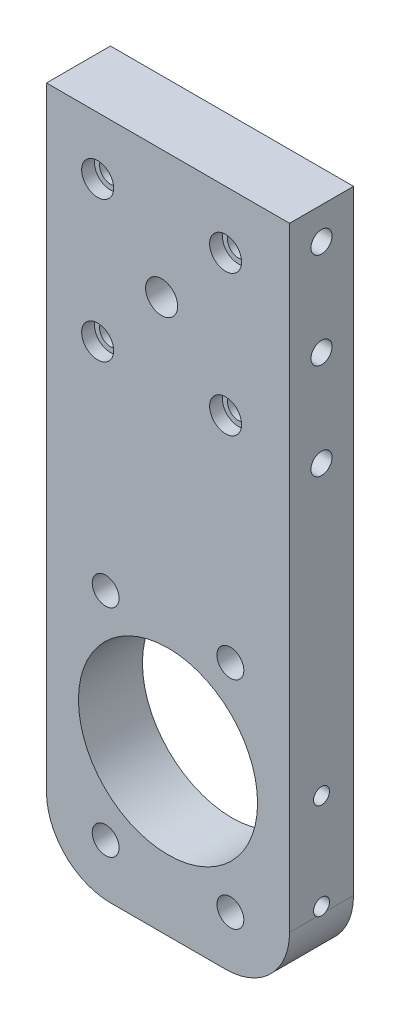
ISO-10303-21;
HEADER;
FILE_DESCRIPTION(('STEP AP214'),'2;1');
FILE_NAME('part.step','',(''),(''),'','','');
FILE_SCHEMA(('AUTOMOTIVE_DESIGN { 1 0 10303 214 1 1 1 1 }'));
ENDSEC;
DATA;
#1=APPLICATION_CONTEXT('core data for automotive mechanical design processes');
#2=APPLICATION_PROTOCOL_DEFINITION('international standard','automotive_design',2000,#1);
#3=PRODUCT_CONTEXT('',#1,'mechanical');
#4=PRODUCT('Part','Part','',(#3));
#5=PRODUCT_RELATED_PRODUCT_CATEGORY('part','',(#4));
#6=PRODUCT_DEFINITION_FORMATION('','',#4);
#7=PRODUCT_DEFINITION_CONTEXT('part definition',#1,'design');
#8=PRODUCT_DEFINITION('design','',#6,#7);
#9=PRODUCT_DEFINITION_SHAPE('','',#8);
#10=(LENGTH_UNIT() NAMED_UNIT(*) SI_UNIT(.MILLI.,.METRE.));
#11=(NAMED_UNIT(*) PLANE_ANGLE_UNIT() SI_UNIT($,.RADIAN.));
#12=(NAMED_UNIT(*) SI_UNIT($,.STERADIAN.) SOLID_ANGLE_UNIT());
#13=UNCERTAINTY_MEASURE_WITH_UNIT(LENGTH_MEASURE(1.E-05),#10,'distance_accuracy_value','');
#14=(GEOMETRIC_REPRESENTATION_CONTEXT(3) GLOBAL_UNCERTAINTY_ASSIGNED_CONTEXT((#13)) GLOBAL_UNIT_ASSIGNED_CONTEXT((#10,
#11,#12)) REPRESENTATION_CONTEXT('',''));
#15=CARTESIAN_POINT('',(0.,0.,0.));
#16=DIRECTION('',(0.,0.,1.));
#17=DIRECTION('',(1.,0.,0.));
#18=AXIS2_PLACEMENT_3D('',#15,#16,#17);
#19=CARTESIAN_POINT('',(12.5,20.,10.));
#20=DIRECTION('',(-1.,0.,0.));
#21=DIRECTION('',(0.,-1.,0.));
#22=AXIS2_PLACEMENT_3D('',#19,#20,#21);
#23=PLANE('',#22);
#24=CARTESIAN_POINT('',(12.5,-60.,5.0000000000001));
#25=DIRECTION('',(1.,0.,0.));
#26=DIRECTION('',(0.,0.,-1.));
#27=AXIS2_PLACEMENT_3D('',#24,#25,#26);
#28=CIRCLE('',#27,1.24999999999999);
#29=CARTESIAN_POINT('',(12.5,-60.,3.75000000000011));
#30=VERTEX_POINT('',#29);
#31=EDGE_CURVE('E726',#30,#30,#28,.T.);
#32=ORIENTED_EDGE('',*,*,#31,.F.);
#33=EDGE_LOOP('',(#32));
#34=FACE_BOUND('',#33,.T.);
#35=CARTESIAN_POINT('',(12.5,15.,5.));
#36=DIRECTION('',(1.,0.,0.));
#37=DIRECTION('',(0.,0.,-1.));
#38=AXIS2_PLACEMENT_3D('',#35,#36,#37);
#39=CIRCLE('',#38,1.65);
#40=CARTESIAN_POINT('',(12.5,15.,3.35));
#41=VERTEX_POINT('',#40);
#42=EDGE_CURVE('E181',#41,#41,#39,.T.);
#43=ORIENTED_EDGE('',*,*,#42,.F.);
#44=EDGE_LOOP('',(#43));
#45=FACE_BOUND('',#44,.T.);
#46=CARTESIAN_POINT('',(12.5,0.,5.));
#47=DIRECTION('',(1.,0.,0.));
#48=DIRECTION('',(0.,0.,-1.));
#49=AXIS2_PLACEMENT_3D('',#46,#47,#48);
#50=CIRCLE('',#49,1.65);
#51=CARTESIAN_POINT('',(12.5,0.,3.35));
#52=VERTEX_POINT('',#51);
#53=EDGE_CURVE('E175',#52,#52,#50,.T.);
#54=ORIENTED_EDGE('',*,*,#53,.F.);
#55=EDGE_LOOP('',(#54));
#56=FACE_BOUND('',#55,.T.);
#57=CARTESIAN_POINT('',(12.5,-15.,5.));
#58=DIRECTION('',(1.,0.,0.));
#59=DIRECTION('',(0.,0.,-1.));
#60=AXIS2_PLACEMENT_3D('',#57,#58,#59);
#61=CIRCLE('',#60,1.65);
#62=CARTESIAN_POINT('',(12.5,-15.,3.35));
#63=VERTEX_POINT('',#62);
#64=EDGE_CURVE('E169',#63,#63,#61,.T.);
#65=ORIENTED_EDGE('',*,*,#64,.F.);
#66=EDGE_LOOP('',(#65));
#67=FACE_BOUND('',#66,.T.);
#68=CARTESIAN_POINT('',(12.5,-75.,5.0000000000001));
#69=DIRECTION('',(1.,0.,0.));
#70=DIRECTION('',(0.,0.,-1.));
#71=AXIS2_PLACEMENT_3D('',#68,#69,#70);
#72=CIRCLE('',#71,1.24999999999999);
#73=CARTESIAN_POINT('',(12.5,-76.,4.24999999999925));
#74=VERTEX_POINT('',#73);
#75=CARTESIAN_POINT('',(12.5,-76.,5.75000000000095));
#76=VERTEX_POINT('',#75);
#77=EDGE_CURVE('E35',#74,#76,#72,.T.);
#78=ORIENTED_EDGE('',*,*,#77,.F.);
#79=DIRECTION('',(0.,0.,1.));
#80=VECTOR('',#79,1.);
#81=CARTESIAN_POINT('',(12.5,-76.,10.));
#82=LINE('',#81,#80);
#83=CARTESIAN_POINT('',(12.5,-76.,0.));
#84=VERTEX_POINT('',#83);
#85=EDGE_CURVE('E266',#74,#84,#82,.F.);
#86=ORIENTED_EDGE('',*,*,#85,.T.);
#87=DIRECTION('',(0.,1.,0.));
#88=VECTOR('',#87,1.);
#89=CARTESIAN_POINT('',(12.5,20.,0.));
#90=LINE('',#89,#88);
#91=CARTESIAN_POINT('',(12.5,20.,0.));
#92=VERTEX_POINT('',#91);
#93=EDGE_CURVE('E229',#84,#92,#90,.T.);
#94=ORIENTED_EDGE('',*,*,#93,.T.);
#95=DIRECTION('',(0.,0.,-1.));
#96=VECTOR('',#95,1.);
#97=CARTESIAN_POINT('',(12.5,20.,10.));
#98=LINE('',#97,#96);
#99=CARTESIAN_POINT('',(12.5,20.,10.));
#100=VERTEX_POINT('',#99);
#101=EDGE_CURVE('E239',#100,#92,#98,.T.);
#102=ORIENTED_EDGE('',*,*,#101,.F.);
#103=DIRECTION('',(0.,1.,0.));
#104=VECTOR('',#103,1.);
#105=CARTESIAN_POINT('',(12.5,20.,10.));
#106=LINE('',#105,#104);
#107=CARTESIAN_POINT('',(12.5,-76.,10.));
#108=VERTEX_POINT('',#107);
#109=EDGE_CURVE('E233',#108,#100,#106,.T.);
#110=ORIENTED_EDGE('',*,*,#109,.F.);
#111=EDGE_CURVE('E267',#108,#76,#82,.F.);
#112=ORIENTED_EDGE('',*,*,#111,.T.);
#113=EDGE_LOOP('',(#78,#86,#94,#102,#110,#112));
#114=FACE_BOUND('',#113,.T.);
#115=ADVANCED_FACE('F16',(#34,#45,#56,#67,#114),#23,.F.);
#116=CARTESIAN_POINT('',(2.5,-11.,0.));
#117=DIRECTION('',(0.,0.,-1.));
#118=DIRECTION('',(-1.,0.,0.));
#119=AXIS2_PLACEMENT_3D('',#116,#117,#118);
#120=CYLINDRICAL_SURFACE('',#119,1.7);
#121=CARTESIAN_POINT('',(2.5,-11.,3.4));
#122=DIRECTION('',(0.,0.,-1.));
#123=DIRECTION('',(-1.,0.,0.));
#124=AXIS2_PLACEMENT_3D('',#121,#122,#123);
#125=CIRCLE('',#124,1.7);
#126=CARTESIAN_POINT('',(0.8,-11.,3.4));
#127=VERTEX_POINT('',#126);
#128=EDGE_CURVE('E226',#127,#127,#125,.T.);
#129=ORIENTED_EDGE('',*,*,#128,.T.);
#130=EDGE_LOOP('',(#129));
#131=FACE_BOUND('',#130,.T.);
#132=CARTESIAN_POINT('',(2.5,-11.,8.));
#133=DIRECTION('',(0.,0.,1.));
#134=DIRECTION('',(1.,0.,0.));
#135=AXIS2_PLACEMENT_3D('',#132,#133,#134);
#136=CIRCLE('',#135,1.7);
#137=CARTESIAN_POINT('',(4.2,-11.,8.));
#138=VERTEX_POINT('',#137);
#139=EDGE_CURVE('E145',#138,#138,#136,.F.);
#140=ORIENTED_EDGE('',*,*,#139,.F.);
#141=EDGE_LOOP('',(#140));
#142=FACE_BOUND('',#141,.T.);
#143=ADVANCED_FACE('F406',(#131,#142),#120,.F.);
#144=CARTESIAN_POINT('',(2.5,11.,0.));
#145=DIRECTION('',(0.,0.,-1.));
#146=DIRECTION('',(-1.,0.,0.));
#147=AXIS2_PLACEMENT_3D('',#144,#145,#146);
#148=CYLINDRICAL_SURFACE('',#147,1.7);
#149=CARTESIAN_POINT('',(2.5,11.,3.4));
#150=DIRECTION('',(0.,0.,-1.));
#151=DIRECTION('',(-1.,0.,0.));
#152=AXIS2_PLACEMENT_3D('',#149,#150,#151);
#153=CIRCLE('',#152,1.7);
#154=CARTESIAN_POINT('',(0.8,11.,3.4));
#155=VERTEX_POINT('',#154);
#156=EDGE_CURVE('E217',#155,#155,#153,.T.);
#157=ORIENTED_EDGE('',*,*,#156,.T.);
#158=EDGE_LOOP('',(#157));
#159=FACE_BOUND('',#158,.T.);
#160=CARTESIAN_POINT('',(2.5,11.,8.));
#161=DIRECTION('',(0.,0.,1.));
#162=DIRECTION('',(1.,0.,0.));
#163=AXIS2_PLACEMENT_3D('',#160,#161,#162);
#164=CIRCLE('',#163,1.7);
#165=CARTESIAN_POINT('',(4.2,11.,8.));
#166=VERTEX_POINT('',#165);
#167=EDGE_CURVE('E151',#166,#166,#164,.F.);
#168=ORIENTED_EDGE('',*,*,#167,.F.);
#169=EDGE_LOOP('',(#168));
#170=FACE_BOUND('',#169,.T.);
#171=ADVANCED_FACE('F394',(#159,#170),#148,.F.);
#172=CARTESIAN_POINT('',(-17.5,11.,0.));
#173=DIRECTION('',(0.,0.,-1.));
#174=DIRECTION('',(-1.,0.,0.));
#175=AXIS2_PLACEMENT_3D('',#172,#173,#174);
#176=CYLINDRICAL_SURFACE('',#175,1.7);
#177=CARTESIAN_POINT('',(-17.5,11.,3.4));
#178=DIRECTION('',(0.,0.,-1.));
#179=DIRECTION('',(-1.,0.,0.));
#180=AXIS2_PLACEMENT_3D('',#177,#178,#179);
#181=CIRCLE('',#180,1.7);
#182=CARTESIAN_POINT('',(-19.2,11.,3.4));
#183=VERTEX_POINT('',#182);
#184=EDGE_CURVE('E208',#183,#183,#181,.T.);
#185=ORIENTED_EDGE('',*,*,#184,.T.);
#186=EDGE_LOOP('',(#185));
#187=FACE_BOUND('',#186,.T.);
#188=CARTESIAN_POINT('',(-17.5,11.,8.));
#189=DIRECTION('',(0.,0.,1.));
#190=DIRECTION('',(1.,0.,0.));
#191=AXIS2_PLACEMENT_3D('',#188,#189,#190);
#192=CIRCLE('',#191,1.7);
#193=CARTESIAN_POINT('',(-15.8,11.,8.));
#194=VERTEX_POINT('',#193);
#195=EDGE_CURVE('E158',#194,#194,#192,.F.);
#196=ORIENTED_EDGE('',*,*,#195,.F.);
#197=EDGE_LOOP('',(#196));
#198=FACE_BOUND('',#197,.T.);
#199=ADVANCED_FACE('F382',(#187,#198),#176,.F.);
#200=CARTESIAN_POINT('',(-17.5,-11.,0.));
#201=DIRECTION('',(0.,0.,-1.));
#202=DIRECTION('',(-1.,0.,0.));
#203=AXIS2_PLACEMENT_3D('',#200,#201,#202);
#204=CYLINDRICAL_SURFACE('',#203,1.7);
#205=CARTESIAN_POINT('',(-17.5,-11.,3.4));
#206=DIRECTION('',(0.,0.,-1.));
#207=DIRECTION('',(-1.,0.,0.));
#208=AXIS2_PLACEMENT_3D('',#205,#206,#207);
#209=CIRCLE('',#208,1.7);
#210=CARTESIAN_POINT('',(-19.2,-11.,3.4));
#211=VERTEX_POINT('',#210);
#212=EDGE_CURVE('E199',#211,#211,#209,.T.);
#213=ORIENTED_EDGE('',*,*,#212,.T.);
#214=EDGE_LOOP('',(#213));
#215=FACE_BOUND('',#214,.T.);
#216=CARTESIAN_POINT('',(-17.5,-11.,8.));
#217=DIRECTION('',(0.,0.,1.));
#218=DIRECTION('',(1.,0.,0.));
#219=AXIS2_PLACEMENT_3D('',#216,#217,#218);
#220=CIRCLE('',#219,1.7);
#221=CARTESIAN_POINT('',(-15.8,-11.,8.));
#222=VERTEX_POINT('',#221);
#223=EDGE_CURVE('E165',#222,#222,#220,.F.);
#224=ORIENTED_EDGE('',*,*,#223,.F.);
#225=EDGE_LOOP('',(#224));
#226=FACE_BOUND('',#225,.T.);
#227=ADVANCED_FACE('F378',(#215,#226),#204,.F.);
#228=CARTESIAN_POINT('',(-27.5,20.,10.));
#229=DIRECTION('',(0.,-1.,0.));
#230=DIRECTION('',(0.,0.,-1.));
#231=AXIS2_PLACEMENT_3D('',#228,#229,#230);
#232=PLANE('',#231);
#233=DIRECTION('',(-1.,0.,0.));
#234=VECTOR('',#233,1.);
#235=CARTESIAN_POINT('',(-27.5,20.,0.));
#236=LINE('',#235,#234);
#237=CARTESIAN_POINT('',(-25.5,20.,0.));
#238=VERTEX_POINT('',#237);
#239=EDGE_CURVE('E234',#92,#238,#236,.T.);
#240=ORIENTED_EDGE('',*,*,#239,.T.);
#241=DIRECTION('',(0.,0.,-1.));
#242=VECTOR('',#241,1.);
#243=CARTESIAN_POINT('',(-25.5,20.,10.));
#244=LINE('',#243,#242);
#245=CARTESIAN_POINT('',(-25.5,20.,10.));
#246=VERTEX_POINT('',#245);
#247=EDGE_CURVE('E243',#246,#238,#244,.T.);
#248=ORIENTED_EDGE('',*,*,#247,.F.);
#249=DIRECTION('',(-1.,0.,0.));
#250=VECTOR('',#249,1.);
#251=CARTESIAN_POINT('',(-27.5,20.,10.));
#252=LINE('',#251,#250);
#253=EDGE_CURVE('E230',#100,#246,#252,.T.);
#254=ORIENTED_EDGE('',*,*,#253,.F.);
#255=ORIENTED_EDGE('',*,*,#101,.T.);
#256=EDGE_LOOP('',(#240,#248,#254,#255));
#257=FACE_BOUND('',#256,.T.);
#258=ADVANCED_FACE('F381',(#257),#232,.F.);
#259=CARTESIAN_POINT('',(-25.5,20.,10.));
#260=DIRECTION('',(1.,0.,0.));
#261=DIRECTION('',(0.,1.,0.));
#262=AXIS2_PLACEMENT_3D('',#259,#260,#261);
#263=PLANE('',#262);
#264=DIRECTION('',(0.,-1.,0.));
#265=VECTOR('',#264,1.);
#266=CARTESIAN_POINT('',(-25.5,20.,0.));
#267=LINE('',#266,#265);
#268=CARTESIAN_POINT('',(-25.5,-76.,0.));
#269=VERTEX_POINT('',#268);
#270=EDGE_CURVE('E236',#238,#269,#267,.T.);
#271=ORIENTED_EDGE('',*,*,#270,.T.);
#272=DIRECTION('',(0.,0.,-1.));
#273=VECTOR('',#272,1.);
#274=CARTESIAN_POINT('',(-25.5,-76.,10.));
#275=LINE('',#274,#273);
#276=CARTESIAN_POINT('',(-25.5,-76.,10.));
#277=VERTEX_POINT('',#276);
#278=EDGE_CURVE('E30',#269,#277,#275,.F.);
#279=ORIENTED_EDGE('',*,*,#278,.T.);
#280=DIRECTION('',(0.,-1.,0.));
#281=VECTOR('',#280,1.);
#282=CARTESIAN_POINT('',(-25.5,20.,10.));
#283=LINE('',#282,#281);
#284=EDGE_CURVE('E232',#246,#277,#283,.T.);
#285=ORIENTED_EDGE('',*,*,#284,.F.);
#286=ORIENTED_EDGE('',*,*,#247,.T.);
#287=EDGE_LOOP('',(#271,#279,#285,#286));
#288=FACE_BOUND('',#287,.T.);
#289=ADVANCED_FACE('F422',(#288),#263,.F.);
#290=CARTESIAN_POINT('',(0.,0.,10.));
#291=DIRECTION('',(0.,0.,1.));
#292=DIRECTION('',(1.,0.,0.));
#293=AXIS2_PLACEMENT_3D('',#290,#291,#292);
#294=PLANE('',#293);
#295=CARTESIAN_POINT('',(-16.25,-44.1125046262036,10.));
#296=DIRECTION('',(0.,0.,-1.));
#297=DIRECTION('',(-1.,0.,0.));
#298=AXIS2_PLACEMENT_3D('',#295,#296,#297);
#299=CIRCLE('',#298,2.1);
#300=CARTESIAN_POINT('',(-18.35,-44.1125046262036,10.));
#301=VERTEX_POINT('',#300);
#302=EDGE_CURVE('E104',#301,#301,#299,.T.);
#303=ORIENTED_EDGE('',*,*,#302,.T.);
#304=EDGE_LOOP('',(#303));
#305=FACE_BOUND('',#304,.T.);
#306=CARTESIAN_POINT('',(-16.25,-77.8874953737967,10.));
#307=DIRECTION('',(0.,0.,-1.));
#308=DIRECTION('',(-1.,0.,0.));
#309=AXIS2_PLACEMENT_3D('',#306,#307,#308);
#310=CIRCLE('',#309,2.1);
#311=CARTESIAN_POINT('',(-18.35,-77.8874953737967,10.));
#312=VERTEX_POINT('',#311);
#313=EDGE_CURVE('E114',#312,#312,#310,.T.);
#314=ORIENTED_EDGE('',*,*,#313,.T.);
#315=EDGE_LOOP('',(#314));
#316=FACE_BOUND('',#315,.T.);
#317=CARTESIAN_POINT('',(3.25,-44.1125046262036,10.));
#318=DIRECTION('',(0.,0.,-1.));
#319=DIRECTION('',(-1.,0.,0.));
#320=AXIS2_PLACEMENT_3D('',#317,#318,#319);
#321=CIRCLE('',#320,2.1);
#322=CARTESIAN_POINT('',(1.15,-44.1125046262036,10.));
#323=VERTEX_POINT('',#322);
#324=EDGE_CURVE('E120',#323,#323,#321,.T.);
#325=ORIENTED_EDGE('',*,*,#324,.T.);
#326=EDGE_LOOP('',(#325));
#327=FACE_BOUND('',#326,.T.);
#328=CARTESIAN_POINT('',(3.25,-77.8874953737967,10.));
#329=DIRECTION('',(0.,0.,-1.));
#330=DIRECTION('',(-1.,0.,0.));
#331=AXIS2_PLACEMENT_3D('',#328,#329,#330);
#332=CIRCLE('',#331,2.1);
#333=CARTESIAN_POINT('',(1.15,-77.8874953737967,10.));
#334=VERTEX_POINT('',#333);
#335=EDGE_CURVE('E126',#334,#334,#332,.T.);
#336=ORIENTED_EDGE('',*,*,#335,.T.);
#337=EDGE_LOOP('',(#336));
#338=FACE_BOUND('',#337,.T.);
#339=CARTESIAN_POINT('',(-6.5,-61.,10.));
#340=DIRECTION('',(0.,0.,1.));
#341=DIRECTION('',(1.,0.,0.));
#342=AXIS2_PLACEMENT_3D('',#339,#340,#341);
#343=CIRCLE('',#342,14.);
#344=CARTESIAN_POINT('',(7.5,-61.,10.));
#345=VERTEX_POINT('',#344);
#346=EDGE_CURVE('E129',#345,#345,#343,.T.);
#347=ORIENTED_EDGE('',*,*,#346,.F.);
#348=EDGE_LOOP('',(#347));
#349=FACE_BOUND('',#348,.T.);
#350=CARTESIAN_POINT('',(2.5,-11.,10.));
#351=DIRECTION('',(0.,0.,1.));
#352=DIRECTION('',(1.,0.,0.));
#353=AXIS2_PLACEMENT_3D('',#350,#351,#352);
#354=CIRCLE('',#353,2.5);
#355=CARTESIAN_POINT('',(5.,-11.,10.));
#356=VERTEX_POINT('',#355);
#357=EDGE_CURVE('E141',#356,#356,#354,.T.);
#358=ORIENTED_EDGE('',*,*,#357,.F.);
#359=EDGE_LOOP('',(#358));
#360=FACE_BOUND('',#359,.T.);
#361=CARTESIAN_POINT('',(2.5,11.,10.));
#362=DIRECTION('',(0.,0.,1.));
#363=DIRECTION('',(1.,0.,0.));
#364=AXIS2_PLACEMENT_3D('',#361,#362,#363);
#365=CIRCLE('',#364,2.5);
#366=CARTESIAN_POINT('',(5.,11.,10.));
#367=VERTEX_POINT('',#366);
#368=EDGE_CURVE('E152',#367,#367,#365,.T.);
#369=ORIENTED_EDGE('',*,*,#368,.F.);
#370=EDGE_LOOP('',(#369));
#371=FACE_BOUND('',#370,.T.);
#372=CARTESIAN_POINT('',(-17.5,11.,10.));
#373=DIRECTION('',(0.,0.,1.));
#374=DIRECTION('',(1.,0.,0.));
#375=AXIS2_PLACEMENT_3D('',#372,#373,#374);
#376=CIRCLE('',#375,2.5);
#377=CARTESIAN_POINT('',(-15.,11.,10.));
#378=VERTEX_POINT('',#377);
#379=EDGE_CURVE('E159',#378,#378,#376,.T.);
#380=ORIENTED_EDGE('',*,*,#379,.F.);
#381=EDGE_LOOP('',(#380));
#382=FACE_BOUND('',#381,.T.);
#383=CARTESIAN_POINT('',(-17.5,-11.,10.));
#384=DIRECTION('',(0.,0.,1.));
#385=DIRECTION('',(1.,0.,0.));
#386=AXIS2_PLACEMENT_3D('',#383,#384,#385);
#387=CIRCLE('',#386,2.5);
#388=CARTESIAN_POINT('',(-15.,-11.,10.));
#389=VERTEX_POINT('',#388);
#390=EDGE_CURVE('E166',#389,#389,#387,.T.);
#391=ORIENTED_EDGE('',*,*,#390,.F.);
#392=EDGE_LOOP('',(#391));
#393=FACE_BOUND('',#392,.T.);
#394=CARTESIAN_POINT('',(-7.5,0.,10.));
#395=DIRECTION('',(0.,0.,-1.));
#396=DIRECTION('',(-1.,0.,0.));
#397=AXIS2_PLACEMENT_3D('',#394,#395,#396);
#398=CIRCLE('',#397,2.5);
#399=CARTESIAN_POINT('',(-10.,0.,10.));
#400=VERTEX_POINT('',#399);
#401=EDGE_CURVE('E190',#400,#400,#398,.T.);
#402=ORIENTED_EDGE('',*,*,#401,.T.);
#403=EDGE_LOOP('',(#402));
#404=FACE_BOUND('',#403,.T.);
#405=DIRECTION('',(-1.,0.,0.));
#406=VECTOR('',#405,1.);
#407=CARTESIAN_POINT('',(12.5,-86.,10.));
#408=LINE('',#407,#406);
#409=CARTESIAN_POINT('',(2.5,-86.,10.));
#410=VERTEX_POINT('',#409);
#411=CARTESIAN_POINT('',(-15.5,-86.,10.));
#412=VERTEX_POINT('',#411);
#413=EDGE_CURVE('E133',#410,#412,#408,.T.);
#414=ORIENTED_EDGE('',*,*,#413,.F.);
#415=CARTESIAN_POINT('',(2.5,-76.,10.));
#416=DIRECTION('',(0.,0.,1.));
#417=DIRECTION('',(1.,0.,0.));
#418=AXIS2_PLACEMENT_3D('',#415,#416,#417);
#419=CIRCLE('',#418,10.);
#420=EDGE_CURVE('E264',#410,#108,#419,.T.);
#421=ORIENTED_EDGE('',*,*,#420,.T.);
#422=ORIENTED_EDGE('',*,*,#109,.T.);
#423=ORIENTED_EDGE('',*,*,#253,.T.);
#424=ORIENTED_EDGE('',*,*,#284,.T.);
#425=CARTESIAN_POINT('',(-15.5,-76.,10.));
#426=DIRECTION('',(0.,0.,1.));
#427=DIRECTION('',(1.,0.,0.));
#428=AXIS2_PLACEMENT_3D('',#425,#426,#427);
#429=CIRCLE('',#428,10.);
#430=EDGE_CURVE('E262',#277,#412,#429,.T.);
#431=ORIENTED_EDGE('',*,*,#430,.T.);
#432=EDGE_LOOP('',(#414,#421,#422,#423,#424,#431));
#433=FACE_BOUND('',#432,.T.);
#434=ADVANCED_FACE('F419',(#305,#316,#327,#338,#349,#360,#371,#382,#393,#404,#433),#294,.T.);
#435=CARTESIAN_POINT('',(0.,0.,0.));
#436=DIRECTION('',(0.,0.,1.));
#437=DIRECTION('',(1.,0.,0.));
#438=AXIS2_PLACEMENT_3D('',#435,#436,#437);
#439=PLANE('',#438);
#440=CARTESIAN_POINT('',(-16.25,-44.1125046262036,0.));
#441=DIRECTION('',(0.,0.,-1.));
#442=DIRECTION('',(-1.,0.,0.));
#443=AXIS2_PLACEMENT_3D('',#440,#441,#442);
#444=CIRCLE('',#443,2.1);
#445=CARTESIAN_POINT('',(-18.35,-44.1125046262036,0.));
#446=VERTEX_POINT('',#445);
#447=EDGE_CURVE('E101',#446,#446,#444,.T.);
#448=ORIENTED_EDGE('',*,*,#447,.F.);
#449=EDGE_LOOP('',(#448));
#450=FACE_BOUND('',#449,.T.);
#451=CARTESIAN_POINT('',(-16.25,-77.8874953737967,0.));
#452=DIRECTION('',(0.,0.,-1.));
#453=DIRECTION('',(-1.,0.,0.));
#454=AXIS2_PLACEMENT_3D('',#451,#452,#453);
#455=CIRCLE('',#454,2.1);
#456=CARTESIAN_POINT('',(-18.35,-77.8874953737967,0.));
#457=VERTEX_POINT('',#456);
#458=EDGE_CURVE('E111',#457,#457,#455,.T.);
#459=ORIENTED_EDGE('',*,*,#458,.F.);
#460=EDGE_LOOP('',(#459));
#461=FACE_BOUND('',#460,.T.);
#462=CARTESIAN_POINT('',(3.25,-44.1125046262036,0.));
#463=DIRECTION('',(0.,0.,-1.));
#464=DIRECTION('',(-1.,0.,0.));
#465=AXIS2_PLACEMENT_3D('',#462,#463,#464);
#466=CIRCLE('',#465,2.1);
#467=CARTESIAN_POINT('',(1.15,-44.1125046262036,0.));
#468=VERTEX_POINT('',#467);
#469=EDGE_CURVE('E117',#468,#468,#466,.T.);
#470=ORIENTED_EDGE('',*,*,#469,.F.);
#471=EDGE_LOOP('',(#470));
#472=FACE_BOUND('',#471,.T.);
#473=CARTESIAN_POINT('',(3.25,-77.8874953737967,0.));
#474=DIRECTION('',(0.,0.,-1.));
#475=DIRECTION('',(-1.,0.,0.));
#476=AXIS2_PLACEMENT_3D('',#473,#474,#475);
#477=CIRCLE('',#476,2.1);
#478=CARTESIAN_POINT('',(1.15,-77.8874953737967,0.));
#479=VERTEX_POINT('',#478);
#480=EDGE_CURVE('E123',#479,#479,#477,.T.);
#481=ORIENTED_EDGE('',*,*,#480,.F.);
#482=EDGE_LOOP('',(#481));
#483=FACE_BOUND('',#482,.T.);
#484=CARTESIAN_POINT('',(-6.5,-61.,0.));
#485=DIRECTION('',(0.,0.,1.));
#486=DIRECTION('',(1.,0.,0.));
#487=AXIS2_PLACEMENT_3D('',#484,#485,#486);
#488=CIRCLE('',#487,14.);
#489=CARTESIAN_POINT('',(7.5,-61.,0.));
#490=VERTEX_POINT('',#489);
#491=EDGE_CURVE('E130',#490,#490,#488,.T.);
#492=ORIENTED_EDGE('',*,*,#491,.T.);
#493=EDGE_LOOP('',(#492));
#494=FACE_BOUND('',#493,.T.);
#495=CARTESIAN_POINT('',(-7.5,0.,0.));
#496=DIRECTION('',(0.,0.,-1.));
#497=DIRECTION('',(-1.,0.,0.));
#498=AXIS2_PLACEMENT_3D('',#495,#496,#497);
#499=CIRCLE('',#498,2.5);
#500=CARTESIAN_POINT('',(-10.,0.,0.));
#501=VERTEX_POINT('',#500);
#502=EDGE_CURVE('E187',#501,#501,#499,.T.);
#503=ORIENTED_EDGE('',*,*,#502,.F.);
#504=EDGE_LOOP('',(#503));
#505=FACE_BOUND('',#504,.T.);
#506=CARTESIAN_POINT('',(-17.5,-11.,0.));
#507=DIRECTION('',(0.,0.,-1.));
#508=DIRECTION('',(-1.,0.,0.));
#509=AXIS2_PLACEMENT_3D('',#506,#507,#508);
#510=CIRCLE('',#509,3.);
#511=CARTESIAN_POINT('',(-20.5,-11.,0.));
#512=VERTEX_POINT('',#511);
#513=EDGE_CURVE('E193',#512,#512,#510,.T.);
#514=ORIENTED_EDGE('',*,*,#513,.F.);
#515=EDGE_LOOP('',(#514));
#516=FACE_BOUND('',#515,.T.);
#517=CARTESIAN_POINT('',(-17.5,11.,0.));
#518=DIRECTION('',(0.,0.,-1.));
#519=DIRECTION('',(-1.,0.,0.));
#520=AXIS2_PLACEMENT_3D('',#517,#518,#519);
#521=CIRCLE('',#520,3.);
#522=CARTESIAN_POINT('',(-20.5,11.,0.));
#523=VERTEX_POINT('',#522);
#524=EDGE_CURVE('E202',#523,#523,#521,.T.);
#525=ORIENTED_EDGE('',*,*,#524,.F.);
#526=EDGE_LOOP('',(#525));
#527=FACE_BOUND('',#526,.T.);
#528=CARTESIAN_POINT('',(2.5,11.,0.));
#529=DIRECTION('',(0.,0.,-1.));
#530=DIRECTION('',(-1.,0.,0.));
#531=AXIS2_PLACEMENT_3D('',#528,#529,#530);
#532=CIRCLE('',#531,3.);
#533=CARTESIAN_POINT('',(-0.5,11.,0.));
#534=VERTEX_POINT('',#533);
#535=EDGE_CURVE('E211',#534,#534,#532,.T.);
#536=ORIENTED_EDGE('',*,*,#535,.F.);
#537=EDGE_LOOP('',(#536));
#538=FACE_BOUND('',#537,.T.);
#539=CARTESIAN_POINT('',(2.5,-11.,0.));
#540=DIRECTION('',(0.,0.,-1.));
#541=DIRECTION('',(-1.,0.,0.));
#542=AXIS2_PLACEMENT_3D('',#539,#540,#541);
#543=CIRCLE('',#542,3.);
#544=CARTESIAN_POINT('',(-0.5,-11.,0.));
#545=VERTEX_POINT('',#544);
#546=EDGE_CURVE('E220',#545,#545,#543,.T.);
#547=ORIENTED_EDGE('',*,*,#546,.F.);
#548=EDGE_LOOP('',(#547));
#549=FACE_BOUND('',#548,.T.);
#550=ORIENTED_EDGE('',*,*,#93,.F.);
#551=CARTESIAN_POINT('',(2.5,-76.,0.));
#552=DIRECTION('',(0.,0.,1.));
#553=DIRECTION('',(1.,0.,0.));
#554=AXIS2_PLACEMENT_3D('',#551,#552,#553);
#555=CIRCLE('',#554,10.);
#556=CARTESIAN_POINT('',(2.5,-86.,0.));
#557=VERTEX_POINT('',#556);
#558=EDGE_CURVE('E271',#84,#557,#555,.F.);
#559=ORIENTED_EDGE('',*,*,#558,.T.);
#560=DIRECTION('',(1.,0.,0.));
#561=VECTOR('',#560,1.);
#562=CARTESIAN_POINT('',(12.5,-86.,0.));
#563=LINE('',#562,#561);
#564=CARTESIAN_POINT('',(-15.5,-86.,0.));
#565=VERTEX_POINT('',#564);
#566=EDGE_CURVE('E138',#565,#557,#563,.T.);
#567=ORIENTED_EDGE('',*,*,#566,.F.);
#568=CARTESIAN_POINT('',(-15.5,-76.,0.));
#569=DIRECTION('',(0.,0.,1.));
#570=DIRECTION('',(1.,0.,0.));
#571=AXIS2_PLACEMENT_3D('',#568,#569,#570);
#572=CIRCLE('',#571,10.);
#573=EDGE_CURVE('E43',#565,#269,#572,.F.);
#574=ORIENTED_EDGE('',*,*,#573,.T.);
#575=ORIENTED_EDGE('',*,*,#270,.F.);
#576=ORIENTED_EDGE('',*,*,#239,.F.);
#577=EDGE_LOOP('',(#550,#559,#567,#574,#575,#576));
#578=FACE_BOUND('',#577,.T.);
#579=ADVANCED_FACE('F414',(#450,#461,#472,#483,#494,#505,#516,#527,#538,#549,#578),#439,.F.);
#580=CARTESIAN_POINT('',(4.2,-11.,3.4));
#581=DIRECTION('',(0.,0.,1.));
#582=DIRECTION('',(1.,0.,0.));
#583=AXIS2_PLACEMENT_3D('',#580,#581,#582);
#584=PLANE('',#583);
#585=ORIENTED_EDGE('',*,*,#128,.F.);
#586=EDGE_LOOP('',(#585));
#587=FACE_BOUND('',#586,.T.);
#588=CARTESIAN_POINT('',(2.5,-11.,3.4));
#589=DIRECTION('',(0.,0.,-1.));
#590=DIRECTION('',(-1.,0.,0.));
#591=AXIS2_PLACEMENT_3D('',#588,#589,#590);
#592=CIRCLE('',#591,3.);
#593=CARTESIAN_POINT('',(-0.5,-11.,3.4));
#594=VERTEX_POINT('',#593);
#595=EDGE_CURVE('E223',#594,#594,#592,.T.);
#596=ORIENTED_EDGE('',*,*,#595,.T.);
#597=EDGE_LOOP('',(#596));
#598=FACE_BOUND('',#597,.T.);
#599=ADVANCED_FACE('F410',(#587,#598),#584,.F.);
#600=CARTESIAN_POINT('',(2.5,-11.,0.));
#601=DIRECTION('',(0.,0.,-1.));
#602=DIRECTION('',(-1.,0.,0.));
#603=AXIS2_PLACEMENT_3D('',#600,#601,#602);
#604=CYLINDRICAL_SURFACE('',#603,3.);
#605=ORIENTED_EDGE('',*,*,#595,.F.);
#606=EDGE_LOOP('',(#605));
#607=FACE_BOUND('',#606,.T.);
#608=ORIENTED_EDGE('',*,*,#546,.T.);
#609=EDGE_LOOP('',(#608));
#610=FACE_BOUND('',#609,.T.);
#611=ADVANCED_FACE('F402',(#607,#610),#604,.F.);
#612=CARTESIAN_POINT('',(4.2,11.,3.4));
#613=DIRECTION('',(0.,0.,1.));
#614=DIRECTION('',(1.,0.,0.));
#615=AXIS2_PLACEMENT_3D('',#612,#613,#614);
#616=PLANE('',#615);
#617=ORIENTED_EDGE('',*,*,#156,.F.);
#618=EDGE_LOOP('',(#617));
#619=FACE_BOUND('',#618,.T.);
#620=CARTESIAN_POINT('',(2.5,11.,3.4));
#621=DIRECTION('',(0.,0.,-1.));
#622=DIRECTION('',(-1.,0.,0.));
#623=AXIS2_PLACEMENT_3D('',#620,#621,#622);
#624=CIRCLE('',#623,3.);
#625=CARTESIAN_POINT('',(-0.5,11.,3.4));
#626=VERTEX_POINT('',#625);
#627=EDGE_CURVE('E214',#626,#626,#624,.T.);
#628=ORIENTED_EDGE('',*,*,#627,.T.);
#629=EDGE_LOOP('',(#628));
#630=FACE_BOUND('',#629,.T.);
#631=ADVANCED_FACE('F398',(#619,#630),#616,.F.);
#632=CARTESIAN_POINT('',(2.5,11.,0.));
#633=DIRECTION('',(0.,0.,-1.));
#634=DIRECTION('',(-1.,0.,0.));
#635=AXIS2_PLACEMENT_3D('',#632,#633,#634);
#636=CYLINDRICAL_SURFACE('',#635,3.);
#637=ORIENTED_EDGE('',*,*,#627,.F.);
#638=EDGE_LOOP('',(#637));
#639=FACE_BOUND('',#638,.T.);
#640=ORIENTED_EDGE('',*,*,#535,.T.);
#641=EDGE_LOOP('',(#640));
#642=FACE_BOUND('',#641,.T.);
#643=ADVANCED_FACE('F390',(#639,#642),#636,.F.);
#644=CARTESIAN_POINT('',(-15.8,11.,3.4));
#645=DIRECTION('',(0.,0.,1.));
#646=DIRECTION('',(1.,0.,0.));
#647=AXIS2_PLACEMENT_3D('',#644,#645,#646);
#648=PLANE('',#647);
#649=ORIENTED_EDGE('',*,*,#184,.F.);
#650=EDGE_LOOP('',(#649));
#651=FACE_BOUND('',#650,.T.);
#652=CARTESIAN_POINT('',(-17.5,11.,3.4));
#653=DIRECTION('',(0.,0.,-1.));
#654=DIRECTION('',(-1.,0.,0.));
#655=AXIS2_PLACEMENT_3D('',#652,#653,#654);
#656=CIRCLE('',#655,3.);
#657=CARTESIAN_POINT('',(-20.5,11.,3.4));
#658=VERTEX_POINT('',#657);
#659=EDGE_CURVE('E205',#658,#658,#656,.T.);
#660=ORIENTED_EDGE('',*,*,#659,.T.);
#661=EDGE_LOOP('',(#660));
#662=FACE_BOUND('',#661,.T.);
#663=ADVANCED_FACE('F386',(#651,#662),#648,.F.);
#664=CARTESIAN_POINT('',(-17.5,11.,0.));
#665=DIRECTION('',(0.,0.,-1.));
#666=DIRECTION('',(-1.,0.,0.));
#667=AXIS2_PLACEMENT_3D('',#664,#665,#666);
#668=CYLINDRICAL_SURFACE('',#667,3.);
#669=ORIENTED_EDGE('',*,*,#659,.F.);
#670=EDGE_LOOP('',(#669));
#671=FACE_BOUND('',#670,.T.);
#672=ORIENTED_EDGE('',*,*,#524,.T.);
#673=EDGE_LOOP('',(#672));
#674=FACE_BOUND('',#673,.T.);
#675=ADVANCED_FACE('F376',(#671,#674),#668,.F.);
#676=CARTESIAN_POINT('',(-15.8,-11.,3.4));
#677=DIRECTION('',(0.,0.,1.));
#678=DIRECTION('',(1.,0.,0.));
#679=AXIS2_PLACEMENT_3D('',#676,#677,#678);
#680=PLANE('',#679);
#681=ORIENTED_EDGE('',*,*,#212,.F.);
#682=EDGE_LOOP('',(#681));
#683=FACE_BOUND('',#682,.T.);
#684=CARTESIAN_POINT('',(-17.5,-11.,3.4));
#685=DIRECTION('',(0.,0.,-1.));
#686=DIRECTION('',(-1.,0.,0.));
#687=AXIS2_PLACEMENT_3D('',#684,#685,#686);
#688=CIRCLE('',#687,3.);
#689=CARTESIAN_POINT('',(-20.5,-11.,3.4));
#690=VERTEX_POINT('',#689);
#691=EDGE_CURVE('E196',#690,#690,#688,.T.);
#692=ORIENTED_EDGE('',*,*,#691,.T.);
#693=EDGE_LOOP('',(#692));
#694=FACE_BOUND('',#693,.T.);
#695=ADVANCED_FACE('F372',(#683,#694),#680,.F.);
#696=CARTESIAN_POINT('',(-17.5,-11.,0.));
#697=DIRECTION('',(0.,0.,-1.));
#698=DIRECTION('',(-1.,0.,0.));
#699=AXIS2_PLACEMENT_3D('',#696,#697,#698);
#700=CYLINDRICAL_SURFACE('',#699,3.);
#701=ORIENTED_EDGE('',*,*,#691,.F.);
#702=EDGE_LOOP('',(#701));
#703=FACE_BOUND('',#702,.T.);
#704=ORIENTED_EDGE('',*,*,#513,.T.);
#705=EDGE_LOOP('',(#704));
#706=FACE_BOUND('',#705,.T.);
#707=ADVANCED_FACE('F368',(#703,#706),#700,.F.);
#708=CARTESIAN_POINT('',(-7.5,0.,0.));
#709=DIRECTION('',(0.,0.,-1.));
#710=DIRECTION('',(-1.,0.,0.));
#711=AXIS2_PLACEMENT_3D('',#708,#709,#710);
#712=CYLINDRICAL_SURFACE('',#711,2.5);
#713=ORIENTED_EDGE('',*,*,#401,.F.);
#714=EDGE_LOOP('',(#713));
#715=FACE_BOUND('',#714,.T.);
#716=ORIENTED_EDGE('',*,*,#502,.T.);
#717=EDGE_LOOP('',(#716));
#718=FACE_BOUND('',#717,.T.);
#719=ADVANCED_FACE('F364',(#715,#718),#712,.F.);
#720=CARTESIAN_POINT('',(2.4,15.,5.));
#721=DIRECTION('',(1.,0.,0.));
#722=DIRECTION('',(0.,0.,-1.));
#723=AXIS2_PLACEMENT_3D('',#720,#721,#722);
#724=CONICAL_SURFACE('',#723,1.65,1.02974425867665);
#725=CARTESIAN_POINT('',(1.40857997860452,15.,5.));
#726=VERTEX_POINT('',#725);
#727=VERTEX_LOOP('',#726);
#728=FACE_BOUND('',#727,.T.);
#729=CARTESIAN_POINT('',(2.4,15.,5.));
#730=DIRECTION('',(1.,0.,0.));
#731=DIRECTION('',(0.,0.,-1.));
#732=AXIS2_PLACEMENT_3D('',#729,#730,#731);
#733=CIRCLE('',#732,1.65);
#734=CARTESIAN_POINT('',(2.4,15.,3.35));
#735=VERTEX_POINT('',#734);
#736=EDGE_CURVE('E184',#735,#735,#733,.T.);
#737=ORIENTED_EDGE('',*,*,#736,.T.);
#738=EDGE_LOOP('',(#737));
#739=FACE_BOUND('',#738,.T.);
#740=ADVANCED_FACE('F360',(#728,#739),#724,.F.);
#741=CARTESIAN_POINT('',(12.5,15.,5.));
#742=DIRECTION('',(1.,0.,0.));
#743=DIRECTION('',(0.,0.,-1.));
#744=AXIS2_PLACEMENT_3D('',#741,#742,#743);
#745=CYLINDRICAL_SURFACE('',#744,1.65);
#746=ORIENTED_EDGE('',*,*,#736,.F.);
#747=EDGE_LOOP('',(#746));
#748=FACE_BOUND('',#747,.T.);
#749=ORIENTED_EDGE('',*,*,#42,.T.);
#750=EDGE_LOOP('',(#749));
#751=FACE_BOUND('',#750,.T.);
#752=ADVANCED_FACE('F356',(#748,#751),#745,.F.);
#753=CARTESIAN_POINT('',(2.4,0.,5.));
#754=DIRECTION('',(1.,0.,0.));
#755=DIRECTION('',(0.,0.,-1.));
#756=AXIS2_PLACEMENT_3D('',#753,#754,#755);
#757=CONICAL_SURFACE('',#756,1.65,1.02974425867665);
#758=CARTESIAN_POINT('',(1.40857997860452,0.,5.));
#759=VERTEX_POINT('',#758);
#760=VERTEX_LOOP('',#759);
#761=FACE_BOUND('',#760,.T.);
#762=CARTESIAN_POINT('',(2.4,0.,5.));
#763=DIRECTION('',(1.,0.,0.));
#764=DIRECTION('',(0.,0.,-1.));
#765=AXIS2_PLACEMENT_3D('',#762,#763,#764);
#766=CIRCLE('',#765,1.65);
#767=CARTESIAN_POINT('',(2.4,0.,3.35));
#768=VERTEX_POINT('',#767);
#769=EDGE_CURVE('E178',#768,#768,#766,.T.);
#770=ORIENTED_EDGE('',*,*,#769,.T.);
#771=EDGE_LOOP('',(#770));
#772=FACE_BOUND('',#771,.T.);
#773=ADVANCED_FACE('F352',(#761,#772),#757,.F.);
#774=CARTESIAN_POINT('',(12.5,0.,5.));
#775=DIRECTION('',(1.,0.,0.));
#776=DIRECTION('',(0.,0.,-1.));
#777=AXIS2_PLACEMENT_3D('',#774,#775,#776);
#778=CYLINDRICAL_SURFACE('',#777,1.65);
#779=ORIENTED_EDGE('',*,*,#769,.F.);
#780=EDGE_LOOP('',(#779));
#781=FACE_BOUND('',#780,.T.);
#782=ORIENTED_EDGE('',*,*,#53,.T.);
#783=EDGE_LOOP('',(#782));
#784=FACE_BOUND('',#783,.T.);
#785=ADVANCED_FACE('F348',(#781,#784),#778,.F.);
#786=CARTESIAN_POINT('',(2.4,-15.,5.));
#787=DIRECTION('',(1.,0.,0.));
#788=DIRECTION('',(0.,0.,-1.));
#789=AXIS2_PLACEMENT_3D('',#786,#787,#788);
#790=CONICAL_SURFACE('',#789,1.65,1.02974425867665);
#791=CARTESIAN_POINT('',(1.40857997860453,-15.,5.));
#792=VERTEX_POINT('',#791);
#793=VERTEX_LOOP('',#792);
#794=FACE_BOUND('',#793,.T.);
#795=CARTESIAN_POINT('',(2.4,-15.,5.));
#796=DIRECTION('',(1.,0.,0.));
#797=DIRECTION('',(0.,0.,-1.));
#798=AXIS2_PLACEMENT_3D('',#795,#796,#797);
#799=CIRCLE('',#798,1.65);
#800=CARTESIAN_POINT('',(2.4,-15.,3.35));
#801=VERTEX_POINT('',#800);
#802=EDGE_CURVE('E172',#801,#801,#799,.T.);
#803=ORIENTED_EDGE('',*,*,#802,.T.);
#804=EDGE_LOOP('',(#803));
#805=FACE_BOUND('',#804,.T.);
#806=ADVANCED_FACE('F344',(#794,#805),#790,.F.);
#807=CARTESIAN_POINT('',(12.5,-15.,5.));
#808=DIRECTION('',(1.,0.,0.));
#809=DIRECTION('',(0.,0.,-1.));
#810=AXIS2_PLACEMENT_3D('',#807,#808,#809);
#811=CYLINDRICAL_SURFACE('',#810,1.65);
#812=ORIENTED_EDGE('',*,*,#802,.F.);
#813=EDGE_LOOP('',(#812));
#814=FACE_BOUND('',#813,.T.);
#815=ORIENTED_EDGE('',*,*,#64,.T.);
#816=EDGE_LOOP('',(#815));
#817=FACE_BOUND('',#816,.T.);
#818=ADVANCED_FACE('F337',(#814,#817),#811,.F.);
#819=CARTESIAN_POINT('',(-17.5,-11.,8.));
#820=DIRECTION('',(0.,0.,1.));
#821=DIRECTION('',(1.,0.,0.));
#822=AXIS2_PLACEMENT_3D('',#819,#820,#821);
#823=PLANE('',#822);
#824=CARTESIAN_POINT('',(-17.5,-11.,8.));
#825=DIRECTION('',(0.,0.,1.));
#826=DIRECTION('',(1.,0.,0.));
#827=AXIS2_PLACEMENT_3D('',#824,#825,#826);
#828=CIRCLE('',#827,2.5);
#829=CARTESIAN_POINT('',(-15.,-11.,8.));
#830=VERTEX_POINT('',#829);
#831=EDGE_CURVE('E162',#830,#830,#828,.T.);
#832=ORIENTED_EDGE('',*,*,#831,.T.);
#833=EDGE_LOOP('',(#832));
#834=FACE_BOUND('',#833,.T.);
#835=ORIENTED_EDGE('',*,*,#223,.T.);
#836=EDGE_LOOP('',(#835));
#837=FACE_BOUND('',#836,.T.);
#838=ADVANCED_FACE('F334',(#834,#837),#823,.T.);
#839=CARTESIAN_POINT('',(-17.5,-11.,8.));
#840=DIRECTION('',(0.,0.,1.));
#841=DIRECTION('',(1.,0.,0.));
#842=AXIS2_PLACEMENT_3D('',#839,#840,#841);
#843=CYLINDRICAL_SURFACE('',#842,2.5);
#844=ORIENTED_EDGE('',*,*,#831,.F.);
#845=EDGE_LOOP('',(#844));
#846=FACE_BOUND('',#845,.T.);
#847=ORIENTED_EDGE('',*,*,#390,.T.);
#848=EDGE_LOOP('',(#847));
#849=FACE_BOUND('',#848,.T.);
#850=ADVANCED_FACE('F329',(#846,#849),#843,.F.);
#851=CARTESIAN_POINT('',(-17.5,11.,8.));
#852=DIRECTION('',(0.,0.,1.));
#853=DIRECTION('',(1.,0.,0.));
#854=AXIS2_PLACEMENT_3D('',#851,#852,#853);
#855=PLANE('',#854);
#856=CARTESIAN_POINT('',(-17.5,11.,8.));
#857=DIRECTION('',(0.,0.,1.));
#858=DIRECTION('',(1.,0.,0.));
#859=AXIS2_PLACEMENT_3D('',#856,#857,#858);
#860=CIRCLE('',#859,2.5);
#861=CARTESIAN_POINT('',(-15.,11.,8.));
#862=VERTEX_POINT('',#861);
#863=EDGE_CURVE('E155',#862,#862,#860,.T.);
#864=ORIENTED_EDGE('',*,*,#863,.T.);
#865=EDGE_LOOP('',(#864));
#866=FACE_BOUND('',#865,.T.);
#867=ORIENTED_EDGE('',*,*,#195,.T.);
#868=EDGE_LOOP('',(#867));
#869=FACE_BOUND('',#868,.T.);
#870=ADVANCED_FACE('F326',(#866,#869),#855,.T.);
#871=CARTESIAN_POINT('',(-17.5,11.,8.));
#872=DIRECTION('',(0.,0.,1.));
#873=DIRECTION('',(1.,0.,0.));
#874=AXIS2_PLACEMENT_3D('',#871,#872,#873);
#875=CYLINDRICAL_SURFACE('',#874,2.5);
#876=ORIENTED_EDGE('',*,*,#863,.F.);
#877=EDGE_LOOP('',(#876));
#878=FACE_BOUND('',#877,.T.);
#879=ORIENTED_EDGE('',*,*,#379,.T.);
#880=EDGE_LOOP('',(#879));
#881=FACE_BOUND('',#880,.T.);
#882=ADVANCED_FACE('F321',(#878,#881),#875,.F.);
#883=CARTESIAN_POINT('',(2.5,11.,8.));
#884=DIRECTION('',(0.,0.,1.));
#885=DIRECTION('',(1.,0.,0.));
#886=AXIS2_PLACEMENT_3D('',#883,#884,#885);
#887=PLANE('',#886);
#888=CARTESIAN_POINT('',(2.5,11.,8.));
#889=DIRECTION('',(0.,0.,1.));
#890=DIRECTION('',(1.,0.,0.));
#891=AXIS2_PLACEMENT_3D('',#888,#889,#890);
#892=CIRCLE('',#891,2.5);
#893=CARTESIAN_POINT('',(5.,11.,8.));
#894=VERTEX_POINT('',#893);
#895=EDGE_CURVE('E148',#894,#894,#892,.T.);
#896=ORIENTED_EDGE('',*,*,#895,.T.);
#897=EDGE_LOOP('',(#896));
#898=FACE_BOUND('',#897,.T.);
#899=ORIENTED_EDGE('',*,*,#167,.T.);
#900=EDGE_LOOP('',(#899));
#901=FACE_BOUND('',#900,.T.);
#902=ADVANCED_FACE('F318',(#898,#901),#887,.T.);
#903=CARTESIAN_POINT('',(2.5,11.,8.));
#904=DIRECTION('',(0.,0.,1.));
#905=DIRECTION('',(1.,0.,0.));
#906=AXIS2_PLACEMENT_3D('',#903,#904,#905);
#907=CYLINDRICAL_SURFACE('',#906,2.5);
#908=ORIENTED_EDGE('',*,*,#895,.F.);
#909=EDGE_LOOP('',(#908));
#910=FACE_BOUND('',#909,.T.);
#911=ORIENTED_EDGE('',*,*,#368,.T.);
#912=EDGE_LOOP('',(#911));
#913=FACE_BOUND('',#912,.T.);
#914=ADVANCED_FACE('F313',(#910,#913),#907,.F.);
#915=CARTESIAN_POINT('',(2.5,-11.,8.));
#916=DIRECTION('',(0.,0.,1.));
#917=DIRECTION('',(1.,0.,0.));
#918=AXIS2_PLACEMENT_3D('',#915,#916,#917);
#919=PLANE('',#918);
#920=CARTESIAN_POINT('',(2.5,-11.,8.));
#921=DIRECTION('',(0.,0.,1.));
#922=DIRECTION('',(1.,0.,0.));
#923=AXIS2_PLACEMENT_3D('',#920,#921,#922);
#924=CIRCLE('',#923,2.5);
#925=CARTESIAN_POINT('',(5.,-11.,8.));
#926=VERTEX_POINT('',#925);
#927=EDGE_CURVE('E142',#926,#926,#924,.T.);
#928=ORIENTED_EDGE('',*,*,#927,.T.);
#929=EDGE_LOOP('',(#928));
#930=FACE_BOUND('',#929,.T.);
#931=ORIENTED_EDGE('',*,*,#139,.T.);
#932=EDGE_LOOP('',(#931));
#933=FACE_BOUND('',#932,.T.);
#934=ADVANCED_FACE('F310',(#930,#933),#919,.T.);
#935=CARTESIAN_POINT('',(2.5,-11.,8.));
#936=DIRECTION('',(0.,0.,1.));
#937=DIRECTION('',(1.,0.,0.));
#938=AXIS2_PLACEMENT_3D('',#935,#936,#937);
#939=CYLINDRICAL_SURFACE('',#938,2.5);
#940=ORIENTED_EDGE('',*,*,#927,.F.);
#941=EDGE_LOOP('',(#940));
#942=FACE_BOUND('',#941,.T.);
#943=ORIENTED_EDGE('',*,*,#357,.T.);
#944=EDGE_LOOP('',(#943));
#945=FACE_BOUND('',#944,.T.);
#946=ADVANCED_FACE('F308',(#942,#945),#939,.F.);
#947=CARTESIAN_POINT('',(0.,-86.,0.));
#948=DIRECTION('',(0.,1.,0.));
#949=DIRECTION('',(0.,0.,1.));
#950=AXIS2_PLACEMENT_3D('',#947,#948,#949);
#951=PLANE('',#950);
#952=ORIENTED_EDGE('',*,*,#566,.T.);
#953=DIRECTION('',(0.,0.,1.));
#954=VECTOR('',#953,1.);
#955=CARTESIAN_POINT('',(2.5,-86.,0.));
#956=LINE('',#955,#954);
#957=EDGE_CURVE('E259',#557,#410,#956,.T.);
#958=ORIENTED_EDGE('',*,*,#957,.T.);
#959=ORIENTED_EDGE('',*,*,#413,.T.);
#960=DIRECTION('',(0.,0.,-1.));
#961=VECTOR('',#960,1.);
#962=CARTESIAN_POINT('',(-15.5,-86.,0.));
#963=LINE('',#962,#961);
#964=EDGE_CURVE('E242',#412,#565,#963,.T.);
#965=ORIENTED_EDGE('',*,*,#964,.T.);
#966=EDGE_LOOP('',(#952,#958,#959,#965));
#967=FACE_BOUND('',#966,.T.);
#968=ADVANCED_FACE('F304',(#967),#951,.F.);
#969=CARTESIAN_POINT('',(-6.5,-61.,0.));
#970=DIRECTION('',(0.,0.,1.));
#971=DIRECTION('',(1.,0.,0.));
#972=AXIS2_PLACEMENT_3D('',#969,#970,#971);
#973=CYLINDRICAL_SURFACE('',#972,14.);
#974=CARTESIAN_POINT('',(7.5,-61.,4.24999999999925));
#975=CARTESIAN_POINT('',(7.49999989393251,-60.9579400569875,4.19392506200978));
#976=CARTESIAN_POINT('',(7.49981056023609,-60.9111244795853,4.14135846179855));
#977=CARTESIAN_POINT('',(7.49879376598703,-60.8093119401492,4.04477865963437));
#978=CARTESIAN_POINT('',(7.49796560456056,-60.7543060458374,4.00077491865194));
#979=CARTESIAN_POINT('',(7.49543316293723,-60.6377256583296,3.92262985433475));
#980=CARTESIAN_POINT('',(7.49372920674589,-60.5761536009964,3.88848489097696));
#981=CARTESIAN_POINT('',(7.48926789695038,-60.4482065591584,3.83101379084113));
#982=CARTESIAN_POINT('',(7.48651079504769,-60.3818327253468,3.80768507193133));
#983=CARTESIAN_POINT('',(7.47985836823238,-60.2462358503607,3.77249471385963));
#984=CARTESIAN_POINT('',(7.47596414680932,-60.1770156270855,3.76062200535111));
#985=CARTESIAN_POINT('',(7.46705867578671,-60.0376341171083,3.74860994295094));
#986=CARTESIAN_POINT('',(7.46204737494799,-59.9674727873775,3.74847112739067));
#987=CARTESIAN_POINT('',(7.45103533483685,-59.8280287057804,3.75990683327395));
#988=CARTESIAN_POINT('',(7.44503235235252,-59.7587483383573,3.77150822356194));
#989=CARTESIAN_POINT('',(7.43229912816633,-59.6231627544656,3.80610326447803));
#990=CARTESIAN_POINT('',(7.42556885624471,-59.5568576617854,3.82909738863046));
#991=CARTESIAN_POINT('',(7.411685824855,-59.4286354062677,3.88600088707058));
#992=CARTESIAN_POINT('',(7.40453060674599,-59.3667495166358,3.91998013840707));
#993=CARTESIAN_POINT('',(7.3902646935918,-59.2495610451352,3.99785667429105));
#994=CARTESIAN_POINT('',(7.38315400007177,-59.1942586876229,4.04175429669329));
#995=CARTESIAN_POINT('',(7.36941403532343,-59.0915835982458,4.1384480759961));
#996=CARTESIAN_POINT('',(7.3627867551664,-59.0442427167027,4.19127835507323));
#997=CARTESIAN_POINT('',(7.35051118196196,-58.9591190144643,4.30424976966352));
#998=CARTESIAN_POINT('',(7.34486286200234,-58.9213359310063,4.36439070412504));
#999=CARTESIAN_POINT('',(7.33499280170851,-58.8566277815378,4.48994141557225));
#1000=CARTESIAN_POINT('',(7.33076334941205,-58.8296438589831,4.55532023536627));
#1001=CARTESIAN_POINT('',(7.3240138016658,-58.7870582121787,4.68976852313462));
#1002=CARTESIAN_POINT('',(7.32149357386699,-58.7714556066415,4.75883770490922));
#1003=CARTESIAN_POINT('',(7.31837967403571,-58.7522281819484,4.89785679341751));
#1004=CARTESIAN_POINT('',(7.31776424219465,-58.7484680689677,4.96778751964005));
#1005=CARTESIAN_POINT('',(7.31844652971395,-58.7526593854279,5.10728578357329));
#1006=CARTESIAN_POINT('',(7.31974417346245,-58.7606103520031,5.17685333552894));
#1007=CARTESIAN_POINT('',(7.32413871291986,-58.787902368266,5.31325915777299));
#1008=CARTESIAN_POINT('',(7.32722576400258,-58.8071811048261,5.38011023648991));
#1009=CARTESIAN_POINT('',(7.33495684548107,-58.8565009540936,5.5096192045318));
#1010=CARTESIAN_POINT('',(7.33960092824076,-58.8865424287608,5.57227695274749));
#1011=CARTESIAN_POINT('',(7.35013995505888,-58.9567461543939,5.6920790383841));
#1012=CARTESIAN_POINT('',(7.35604291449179,-58.996973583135,5.74918446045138));
#1013=CARTESIAN_POINT('',(7.3686627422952,-59.0863063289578,5.85586510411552));
#1014=CARTESIAN_POINT('',(7.37537966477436,-59.1354122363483,5.90543982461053));
#1015=CARTESIAN_POINT('',(7.38925631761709,-59.2417450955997,5.99623898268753));
#1016=CARTESIAN_POINT('',(7.39642020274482,-59.2990577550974,6.03736244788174));
#1017=CARTESIAN_POINT('',(7.41066498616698,-59.4197818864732,6.10940911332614));
#1018=CARTESIAN_POINT('',(7.4177458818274,-59.4831935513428,6.14033199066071));
#1019=CARTESIAN_POINT('',(7.43144783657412,-59.6146677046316,6.19122238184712));
#1020=CARTESIAN_POINT('',(7.43806657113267,-59.6827507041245,6.21113757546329));
#1021=CARTESIAN_POINT('',(7.4504725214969,-59.8213752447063,6.23919075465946));
#1022=CARTESIAN_POINT('',(7.4562597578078,-59.8919167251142,6.2473290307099));
#1023=CARTESIAN_POINT('',(7.46675149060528,-60.033127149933,6.25154705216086));
#1024=CARTESIAN_POINT('',(7.47146065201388,-60.1037941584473,6.24767984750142));
#1025=CARTESIAN_POINT('',(7.47972296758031,-60.2435309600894,6.22807564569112));
#1026=CARTESIAN_POINT('',(7.4832761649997,-60.3126008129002,6.2123390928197));
#1027=CARTESIAN_POINT('',(7.48922290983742,-60.4467156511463,6.16955903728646));
#1028=CARTESIAN_POINT('',(7.49162362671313,-60.5117832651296,6.14258744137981));
#1029=CARTESIAN_POINT('',(7.49541931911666,-60.6364966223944,6.07810013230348));
#1030=CARTESIAN_POINT('',(7.49681430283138,-60.6961424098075,6.04058450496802));
#1031=CARTESIAN_POINT('',(7.49879827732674,-60.8082001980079,5.95615116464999));
#1032=CARTESIAN_POINT('',(7.49938874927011,-60.8606253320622,5.90925091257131));
#1033=CARTESIAN_POINT('',(7.50001655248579,-60.9568842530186,5.80733258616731));
#1034=CARTESIAN_POINT('',(7.50005387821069,-61.0007179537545,5.75231443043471));
#1035=CARTESIAN_POINT('',(7.49983373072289,-61.0786162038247,5.6356226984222));
#1036=CARTESIAN_POINT('',(7.49957578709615,-61.1126650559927,5.57393864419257));
#1037=CARTESIAN_POINT('',(7.49899805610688,-61.1699349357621,5.44573644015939));
#1038=CARTESIAN_POINT('',(7.4986782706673,-61.1931562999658,5.37921844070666));
#1039=CARTESIAN_POINT('',(7.49815218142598,-61.2281329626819,5.24316272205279));
#1040=CARTESIAN_POINT('',(7.49794599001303,-61.2398769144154,5.17362208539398));
#1041=CARTESIAN_POINT('',(7.49774160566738,-61.2515252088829,5.03353838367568));
#1042=CARTESIAN_POINT('',(7.49774346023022,-61.2514268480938,4.96299509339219));
#1043=CARTESIAN_POINT('',(7.49795442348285,-61.2393888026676,4.82290820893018));
#1044=CARTESIAN_POINT('',(7.4981636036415,-61.2274450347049,4.75336496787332));
#1045=CARTESIAN_POINT('',(7.4986937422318,-61.1920532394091,4.6173273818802));
#1046=CARTESIAN_POINT('',(7.49901457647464,-61.1686179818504,4.55082974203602));
#1047=CARTESIAN_POINT('',(7.49949009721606,-61.1209376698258,4.4449198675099));
#1048=CARTESIAN_POINT('',(7.49966387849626,-61.0997732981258,4.40409126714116));
#1049=CARTESIAN_POINT('',(7.49991886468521,-61.0530868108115,4.32500615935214));
#1050=CARTESIAN_POINT('',(7.50000006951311,-61.0275646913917,4.286749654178));
#1051=CARTESIAN_POINT('',(7.5,-61.,4.24999999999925));
#1052=B_SPLINE_CURVE_WITH_KNOTS('',3,(#974,#975,#976,#977,#978,#979,#980,#981,#982,#983,#984,
#985,#986,#987,#988,#989,#990,#991,#992,#993,#994,#995,#996,#997,#998,#999,#1000,#1001,#1002,
#1003,#1004,#1005,#1006,#1007,#1008,#1009,#1010,#1011,#1012,#1013,#1014,#1015,#1016,#1017,#1018,
#1019,#1020,#1021,#1022,#1023,#1024,#1025,#1026,#1027,#1028,#1029,#1030,#1031,#1032,#1033,#1034,
#1035,#1036,#1037,#1038,#1039,#1040,#1041,#1042,#1043,#1044,#1045,#1046,#1047,#1048,#1049,#1050,
#1051),.UNSPECIFIED.,.T.,.F.,(4,2,2,2,2,2,2,2,2,2,2,2,2,2,2,2,2,2,2,2,2,2,2,2,2,2,2,2,2,2,2,2,2,
2,2,2,2,2,4),(0.,0.210120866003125,0.420472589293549,0.630746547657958,0.840970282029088,
1.05099068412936,1.26102072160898,1.47153252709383,1.68205308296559,1.8939400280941,
2.10583419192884,2.31855686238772,2.53127368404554,2.74281485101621,2.95433963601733,
3.16343893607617,3.37252997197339,3.58048144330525,3.78843990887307,3.99776425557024,
4.20710252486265,4.41881259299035,4.63052936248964,4.8432439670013,5.05595332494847,
5.26772410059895,5.47948694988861,5.68991480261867,5.90034094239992,6.1103791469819,
6.32041945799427,6.53079486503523,6.7411637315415,6.95174036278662,7.16236506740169,
7.37306240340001,7.5835261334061,7.72123225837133,7.85893850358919),.UNSPECIFIED.);
#1053=CARTESIAN_POINT('',(7.5,-61.,4.24999999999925));
#1054=VERTEX_POINT('',#1053);
#1055=EDGE_CURVE('E20',#1054,#1054,#1052,.T.);
#1056=ORIENTED_EDGE('',*,*,#1055,.T.);
#1057=EDGE_LOOP('',(#1056));
#1058=FACE_BOUND('',#1057,.T.);
#1059=ORIENTED_EDGE('',*,*,#491,.F.);
#1060=EDGE_LOOP('',(#1059));
#1061=FACE_BOUND('',#1060,.T.);
#1062=ORIENTED_EDGE('',*,*,#346,.T.);
#1063=EDGE_LOOP('',(#1062));
#1064=FACE_BOUND('',#1063,.T.);
#1065=ADVANCED_FACE('F300',(#1058,#1061,#1064),#973,.F.);
#1066=CARTESIAN_POINT('',(2.5,-76.,0.));
#1067=DIRECTION('',(0.,0.,1.));
#1068=DIRECTION('',(1.,0.,0.));
#1069=AXIS2_PLACEMENT_3D('',#1066,#1067,#1068);
#1070=CYLINDRICAL_SURFACE('',#1069,10.);
#1071=CARTESIAN_POINT('',(12.5,-76.,5.75000000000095));
#1072=CARTESIAN_POINT('',(12.4999996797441,-76.0210970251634,5.72187024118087));
#1073=CARTESIAN_POINT('',(12.499933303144,-76.0409965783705,5.69286360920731));
#1074=CARTESIAN_POINT('',(12.4997110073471,-76.0782823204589,5.63328002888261));
#1075=CARTESIAN_POINT('',(12.4995550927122,-76.0956686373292,5.60270316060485));
#1076=CARTESIAN_POINT('',(12.4990173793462,-76.1438381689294,5.50897543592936));
#1077=CARTESIAN_POINT('',(12.4985653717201,-76.1706916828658,5.44374767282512));
#1078=CARTESIAN_POINT('',(12.4977525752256,-76.2130641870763,5.30971630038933));
#1079=CARTESIAN_POINT('',(12.4973918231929,-76.2285786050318,5.24091126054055));
#1080=CARTESIAN_POINT('',(12.4969330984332,-76.2478361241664,5.10168192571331));
#1081=CARTESIAN_POINT('',(12.4968350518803,-76.2515825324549,5.03125809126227));
#1082=CARTESIAN_POINT('',(12.4969443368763,-76.247201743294,4.89078587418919));
#1083=CARTESIAN_POINT('',(12.4971516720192,-76.2390744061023,4.82073749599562));
#1084=CARTESIAN_POINT('',(12.4977796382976,-76.2111721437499,4.68298451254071));
#1085=CARTESIAN_POINT('',(12.498200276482,-76.19139683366,4.61527998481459));
#1086=CARTESIAN_POINT('',(12.4989636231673,-76.1454384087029,4.49625613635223));
#1087=CARTESIAN_POINT('',(12.4993064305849,-76.1211036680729,4.44421403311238));
#1088=CARTESIAN_POINT('',(12.4998223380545,-76.0655739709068,4.34399354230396));
#1089=CARTESIAN_POINT('',(12.4999955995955,-76.0343855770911,4.29581151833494));
#1090=CARTESIAN_POINT('',(12.5,-76.,4.24999999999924));
#1091=B_SPLINE_CURVE_WITH_KNOTS('',3,(#1071,#1072,#1073,#1074,#1075,#1076,#1077,#1078,#1079,
#1080,#1081,#1082,#1083,#1084,#1085,#1086,#1087,#1088,#1089,#1090),.UNSPECIFIED.,.F.,.F.,(4,2,2,
2,2,2,2,2,2,4),(0.,0.105421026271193,0.210836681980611,0.421372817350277,0.631993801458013,
0.842555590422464,1.05311985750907,1.26369108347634,1.43551989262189,1.60718487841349),.UNSPECIFIED.);
#1092=EDGE_CURVE('E11',#76,#74,#1091,.T.);
#1093=ORIENTED_EDGE('',*,*,#1092,.F.);
#1094=ORIENTED_EDGE('',*,*,#111,.F.);
#1095=ORIENTED_EDGE('',*,*,#420,.F.);
#1096=ORIENTED_EDGE('',*,*,#957,.F.);
#1097=ORIENTED_EDGE('',*,*,#558,.F.);
#1098=ORIENTED_EDGE('',*,*,#85,.F.);
#1099=EDGE_LOOP('',(#1093,#1094,#1095,#1096,#1097,#1098));
#1100=FACE_BOUND('',#1099,.T.);
#1101=ADVANCED_FACE('F278',(#1100),#1070,.T.);
#1102=CARTESIAN_POINT('',(-15.5,-76.,0.));
#1103=DIRECTION('',(0.,0.,-1.));
#1104=DIRECTION('',(-1.,0.,0.));
#1105=AXIS2_PLACEMENT_3D('',#1102,#1103,#1104);
#1106=CYLINDRICAL_SURFACE('',#1105,10.);
#1107=ORIENTED_EDGE('',*,*,#430,.F.);
#1108=ORIENTED_EDGE('',*,*,#278,.F.);
#1109=ORIENTED_EDGE('',*,*,#573,.F.);
#1110=ORIENTED_EDGE('',*,*,#964,.F.);
#1111=EDGE_LOOP('',(#1107,#1108,#1109,#1110));
#1112=FACE_BOUND('',#1111,.T.);
#1113=ADVANCED_FACE('F18',(#1112),#1106,.T.);
#1114=CARTESIAN_POINT('',(3.25,-77.8874953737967,0.));
#1115=DIRECTION('',(0.,0.,-1.));
#1116=DIRECTION('',(-1.,0.,0.));
#1117=AXIS2_PLACEMENT_3D('',#1114,#1115,#1116);
#1118=CYLINDRICAL_SURFACE('',#1117,2.1);
#1119=ORIENTED_EDGE('',*,*,#335,.F.);
#1120=EDGE_LOOP('',(#1119));
#1121=FACE_BOUND('',#1120,.T.);
#1122=ORIENTED_EDGE('',*,*,#480,.T.);
#1123=EDGE_LOOP('',(#1122));
#1124=FACE_BOUND('',#1123,.T.);
#1125=ADVANCED_FACE('F296',(#1121,#1124),#1118,.F.);
#1126=CARTESIAN_POINT('',(3.25,-44.1125046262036,0.));
#1127=DIRECTION('',(0.,0.,-1.));
#1128=DIRECTION('',(-1.,0.,0.));
#1129=AXIS2_PLACEMENT_3D('',#1126,#1127,#1128);
#1130=CYLINDRICAL_SURFACE('',#1129,2.1);
#1131=ORIENTED_EDGE('',*,*,#324,.F.);
#1132=EDGE_LOOP('',(#1131));
#1133=FACE_BOUND('',#1132,.T.);
#1134=ORIENTED_EDGE('',*,*,#469,.T.);
#1135=EDGE_LOOP('',(#1134));
#1136=FACE_BOUND('',#1135,.T.);
#1137=ADVANCED_FACE('F292',(#1133,#1136),#1130,.F.);
#1138=CARTESIAN_POINT('',(-16.25,-77.8874953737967,0.));
#1139=DIRECTION('',(0.,0.,-1.));
#1140=DIRECTION('',(-1.,0.,0.));
#1141=AXIS2_PLACEMENT_3D('',#1138,#1139,#1140);
#1142=CYLINDRICAL_SURFACE('',#1141,2.1);
#1143=ORIENTED_EDGE('',*,*,#313,.F.);
#1144=EDGE_LOOP('',(#1143));
#1145=FACE_BOUND('',#1144,.T.);
#1146=ORIENTED_EDGE('',*,*,#458,.T.);
#1147=EDGE_LOOP('',(#1146));
#1148=FACE_BOUND('',#1147,.T.);
#1149=ADVANCED_FACE('F288',(#1145,#1148),#1142,.F.);
#1150=CARTESIAN_POINT('',(-16.25,-44.1125046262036,0.));
#1151=DIRECTION('',(0.,0.,-1.));
#1152=DIRECTION('',(-1.,0.,0.));
#1153=AXIS2_PLACEMENT_3D('',#1150,#1151,#1152);
#1154=CYLINDRICAL_SURFACE('',#1153,2.1);
#1155=ORIENTED_EDGE('',*,*,#302,.F.);
#1156=EDGE_LOOP('',(#1155));
#1157=FACE_BOUND('',#1156,.T.);
#1158=ORIENTED_EDGE('',*,*,#447,.T.);
#1159=EDGE_LOOP('',(#1158));
#1160=FACE_BOUND('',#1159,.T.);
#1161=ADVANCED_FACE('F95',(#1157,#1160),#1154,.F.);
#1162=CARTESIAN_POINT('',(5.,-75.,5.0000000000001));
#1163=DIRECTION('',(1.,0.,0.));
#1164=DIRECTION('',(0.,0.,-1.));
#1165=AXIS2_PLACEMENT_3D('',#1162,#1163,#1164);
#1166=CONICAL_SURFACE('',#1165,1.25,1.02974425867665);
#1167=CARTESIAN_POINT('',(4.24892422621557,-75.,5.0000000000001));
#1168=VERTEX_POINT('',#1167);
#1169=VERTEX_LOOP('',#1168);
#1170=FACE_BOUND('',#1169,.T.);
#1171=CARTESIAN_POINT('',(5.,-75.,5.0000000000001));
#1172=DIRECTION('',(1.,0.,0.));
#1173=DIRECTION('',(0.,0.,-1.));
#1174=AXIS2_PLACEMENT_3D('',#1171,#1172,#1173);
#1175=CIRCLE('',#1174,1.25);
#1176=CARTESIAN_POINT('',(5.,-75.,3.7500000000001));
#1177=VERTEX_POINT('',#1176);
#1178=EDGE_CURVE('E99',#1177,#1177,#1175,.T.);
#1179=ORIENTED_EDGE('',*,*,#1178,.T.);
#1180=EDGE_LOOP('',(#1179));
#1181=FACE_BOUND('',#1180,.T.);
#1182=ADVANCED_FACE('F91',(#1170,#1181),#1166,.F.);
#1183=CARTESIAN_POINT('',(12.5,-75.,5.0000000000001));
#1184=DIRECTION('',(1.,0.,0.));
#1185=DIRECTION('',(0.,0.,-1.));
#1186=AXIS2_PLACEMENT_3D('',#1183,#1184,#1185);
#1187=CYLINDRICAL_SURFACE('',#1186,1.25);
#1188=ORIENTED_EDGE('',*,*,#1092,.T.);
#1189=ORIENTED_EDGE('',*,*,#77,.T.);
#1190=EDGE_LOOP('',(#1188,#1189));
#1191=FACE_BOUND('',#1190,.T.);
#1192=ORIENTED_EDGE('',*,*,#1178,.F.);
#1193=EDGE_LOOP('',(#1192));
#1194=FACE_BOUND('',#1193,.T.);
#1195=ADVANCED_FACE('F94',(#1191,#1194),#1187,.F.);
#1196=CARTESIAN_POINT('',(12.5,-60.,5.0000000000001));
#1197=DIRECTION('',(1.,0.,0.));
#1198=DIRECTION('',(0.,0.,-1.));
#1199=AXIS2_PLACEMENT_3D('',#1196,#1197,#1198);
#1200=CYLINDRICAL_SURFACE('',#1199,1.25);
#1201=ORIENTED_EDGE('',*,*,#31,.T.);
#1202=EDGE_LOOP('',(#1201));
#1203=FACE_BOUND('',#1202,.T.);
#1204=ORIENTED_EDGE('',*,*,#1055,.F.);
#1205=EDGE_LOOP('',(#1204));
#1206=FACE_BOUND('',#1205,.T.);
#1207=ADVANCED_FACE('F283',(#1203,#1206),#1200,.F.);
#1208=CLOSED_SHELL('',(#115,#143,#171,#199,#227,#258,#289,#434,#579,#599,#611,#631,#643,#663,
#675,#695,#707,#719,#740,#752,#773,#785,#806,#818,#838,#850,#870,#882,#902,#914,#934,#946,#968,
#1065,#1101,#1113,#1125,#1137,#1149,#1161,#1182,#1195,#1207));
#1209=MANIFOLD_SOLID_BREP('B1',#1208);
#1210=ADVANCED_BREP_SHAPE_REPRESENTATION('',(#18,#1209),#14);
#1211=SHAPE_DEFINITION_REPRESENTATION(#9,#1210);
ENDSEC;
END-ISO-10303-21;
